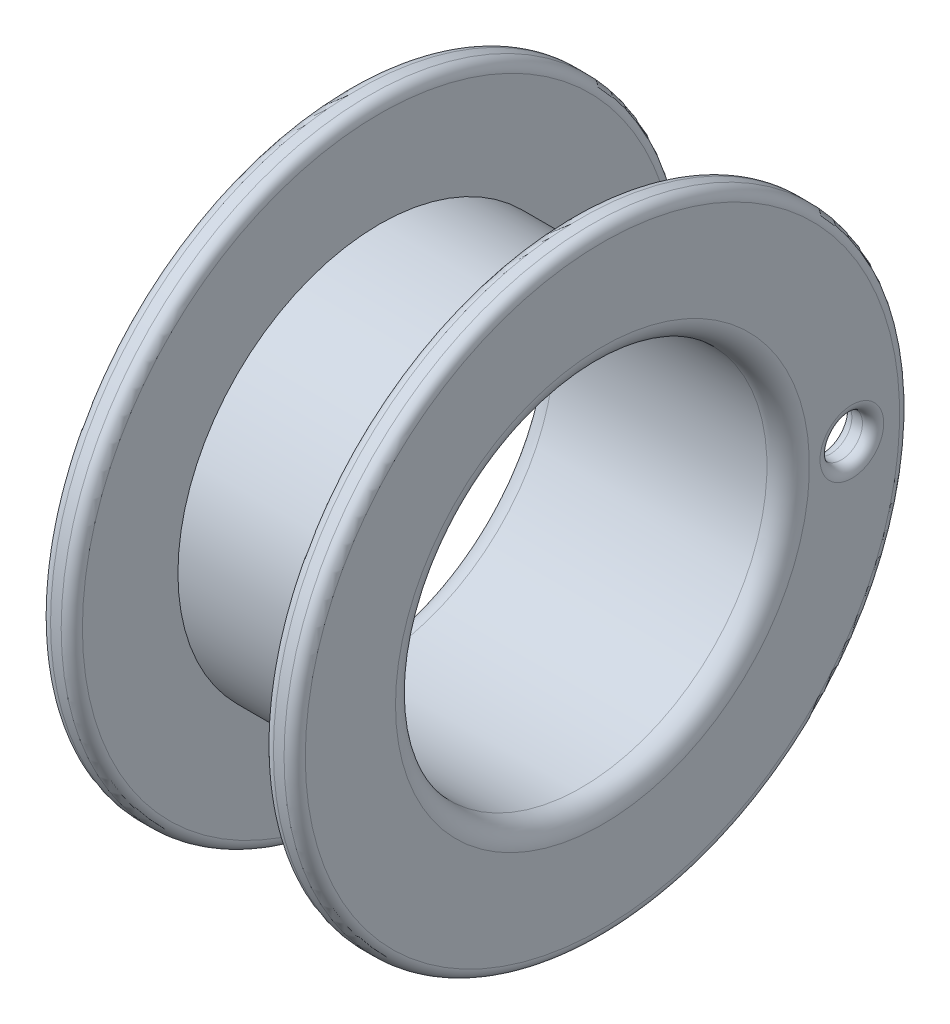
from build123d import *

# Parameters (mm, degrees)
ESQUISSE2_R             = 17.5
ENL_V_MAT_EXTRU_1_DEPTH = 48.518417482
CONG_1_R                = 1
CONG_2_R                = 2
ESQUISSE3_R             = 2
ENL_V_MAT_EXTRU_2_DEPTH = 48.518417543
CONG_3_R                = 1


with BuildPart() as part:
    # Esquisse1 → R_volution1 (revolve)
    with BuildSketch(Plane(origin=(0, 0, 0), x_dir=(1, 0, 0), z_dir=(0, 1, 0)), mode=Mode.PRIVATE) as r_volution1_sk:
        Polygon((0, 0), (0, 29), (3, 29), (3, 19), (21, 19), (21, 29), (24, 29), (24, 0), align=None)
    revolve(r_volution1_sk.sketch.rotate(Axis((0, 0, 0), (1, 0, 0)), 180), axis=Axis((0, 0, 0), (1, 0, 0)))

    # Esquisse2 → Enl_v. mat.-Extru.1 (cut, through all)
    with BuildSketch(Plane(origin=(0, 0, 0), x_dir=(0, 0, -1), z_dir=(1, 0, 0))):
        Circle(ESQUISSE2_R)
    extrude(amount=ENL_V_MAT_EXTRU_1_DEPTH, mode=Mode.SUBTRACT)

    # Cong_1
    cong_1_edges = [part.edges().sort_by_distance(p)[0] for p in [
        (24, 0, -29),
        (21, 0, -29),
        (3, 0, -29),
        (0, 0, -29),
    ]]
    fillet(cong_1_edges, radius=CONG_1_R)

    # Cong_2
    cong_2_edges = [part.edges().sort_by_distance(p)[0] for p in [
        (0, 0, 17.5),
        (24, 0, 17.5),
    ]]
    fillet(cong_2_edges, radius=CONG_2_R)

    # Esquisse3 → Enl_v. mat.-Extru.2 (cut, through all)
    with BuildSketch(Plane(origin=(0, 0, 0), x_dir=(0, 0, -1), z_dir=(1, 0, 0))):
        with Locations((23.5, 0)):
            Circle(ESQUISSE3_R)
    extrude(amount=ENL_V_MAT_EXTRU_2_DEPTH, mode=Mode.SUBTRACT)

    # Cong_3
    cong_3_edges = [part.edges().sort_by_distance(p)[0] for p in [
        (0, 0, -21.5),
        (3, 0, -21.5),
        (21, 0, -21.5),
        (24, 0, -21.5),
    ]]
    fillet(cong_3_edges, radius=CONG_3_R)


solid = part.part
